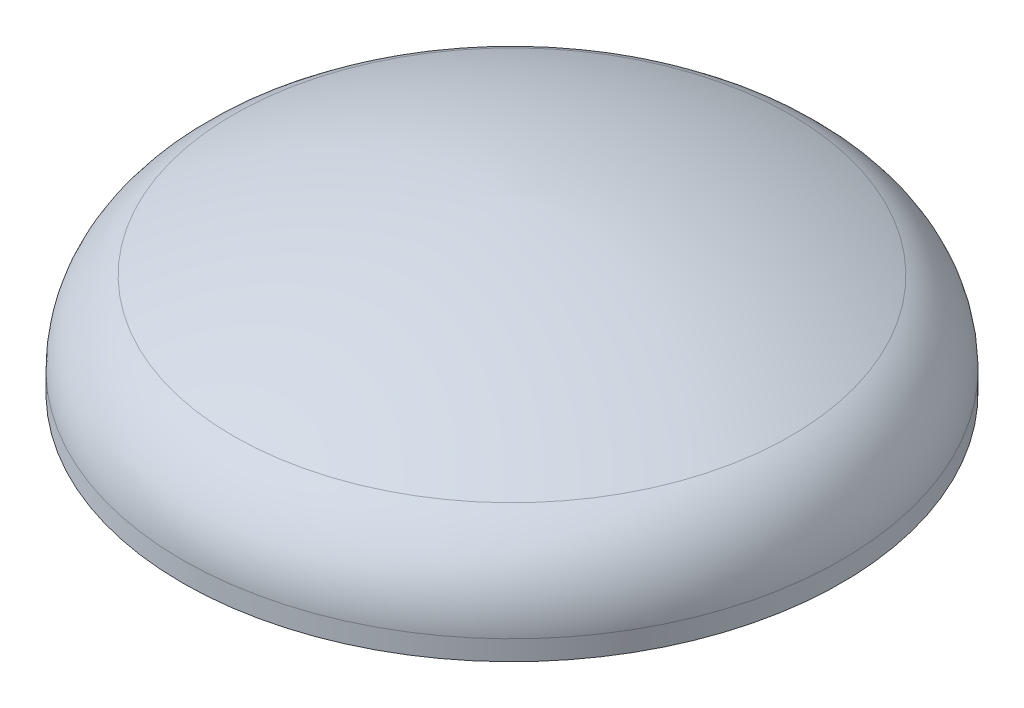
ISO-10303-21;
HEADER;
FILE_DESCRIPTION(('STEP AP214'),'2;1');
FILE_NAME('part.step','',(''),(''),'','','');
FILE_SCHEMA(('AUTOMOTIVE_DESIGN { 1 0 10303 214 1 1 1 1 }'));
ENDSEC;
DATA;
#1=APPLICATION_CONTEXT('core data for automotive mechanical design processes');
#2=APPLICATION_PROTOCOL_DEFINITION('international standard','automotive_design',2000,#1);
#3=PRODUCT_CONTEXT('',#1,'mechanical');
#4=PRODUCT('Part','Part','',(#3));
#5=PRODUCT_RELATED_PRODUCT_CATEGORY('part','',(#4));
#6=PRODUCT_DEFINITION_FORMATION('','',#4);
#7=PRODUCT_DEFINITION_CONTEXT('part definition',#1,'design');
#8=PRODUCT_DEFINITION('design','',#6,#7);
#9=PRODUCT_DEFINITION_SHAPE('','',#8);
#10=(LENGTH_UNIT() NAMED_UNIT(*) SI_UNIT(.MILLI.,.METRE.));
#11=(NAMED_UNIT(*) PLANE_ANGLE_UNIT() SI_UNIT($,.RADIAN.));
#12=(NAMED_UNIT(*) SI_UNIT($,.STERADIAN.) SOLID_ANGLE_UNIT());
#13=UNCERTAINTY_MEASURE_WITH_UNIT(LENGTH_MEASURE(1.E-05),#10,'distance_accuracy_value','');
#14=(GEOMETRIC_REPRESENTATION_CONTEXT(3) GLOBAL_UNCERTAINTY_ASSIGNED_CONTEXT((#13)) GLOBAL_UNIT_ASSIGNED_CONTEXT((#10,
#11,#12)) REPRESENTATION_CONTEXT('',''));
#15=CARTESIAN_POINT('',(0.,0.,0.));
#16=DIRECTION('',(0.,0.,1.));
#17=DIRECTION('',(1.,0.,0.));
#18=AXIS2_PLACEMENT_3D('',#15,#16,#17);
#19=CARTESIAN_POINT('',(0.,2.34505674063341,0.));
#20=DIRECTION('',(0.,1.,0.));
#21=DIRECTION('',(0.,0.,1.));
#22=AXIS2_PLACEMENT_3D('',#19,#20,#21);
#23=CONICAL_SURFACE('',#22,38.05,1.0471975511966);
#24=CARTESIAN_POINT('',(0.,0.670740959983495,0.));
#25=DIRECTION('',(0.,1.,0.));
#26=DIRECTION('',(0.,0.,1.));
#27=AXIS2_PLACEMENT_3D('',#24,#25,#26);
#28=CIRCLE('',#27,35.15);
#29=CARTESIAN_POINT('',(0.,0.670740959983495,35.15));
#30=VERTEX_POINT('',#29);
#31=EDGE_CURVE('E11',#30,#30,#28,.T.);
#32=ORIENTED_EDGE('',*,*,#31,.T.);
#33=EDGE_LOOP('',(#32));
#34=FACE_BOUND('',#33,.T.);
#35=CARTESIAN_POINT('',(0.,2.34505674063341,0.));
#36=DIRECTION('',(0.,1.,0.));
#37=DIRECTION('',(0.,0.,1.));
#38=AXIS2_PLACEMENT_3D('',#35,#36,#37);
#39=CIRCLE('',#38,38.05);
#40=CARTESIAN_POINT('',(0.,2.34505674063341,38.05));
#41=VERTEX_POINT('',#40);
#42=EDGE_CURVE('E74',#41,#41,#39,.T.);
#43=ORIENTED_EDGE('',*,*,#42,.F.);
#44=EDGE_LOOP('',(#43));
#45=FACE_BOUND('',#44,.T.);
#46=ADVANCED_FACE('F42',(#34,#45),#23,.T.);
#47=CARTESIAN_POINT('',(0.,18.1666064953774,0.));
#48=DIRECTION('',(0.,1.,0.));
#49=DIRECTION('',(0.,0.,1.));
#50=AXIS2_PLACEMENT_3D('',#47,#48,#49);
#51=CYLINDRICAL_SURFACE('',#50,35.15);
#52=CARTESIAN_POINT('',(0.,4.63671653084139,0.));
#53=DIRECTION('',(0.,1.,0.));
#54=DIRECTION('',(0.,0.,1.));
#55=AXIS2_PLACEMENT_3D('',#52,#53,#54);
#56=CIRCLE('',#55,35.15);
#57=CARTESIAN_POINT('',(0.,4.63671653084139,35.15));
#58=VERTEX_POINT('',#57);
#59=EDGE_CURVE('E49',#58,#58,#56,.T.);
#60=ORIENTED_EDGE('',*,*,#59,.T.);
#61=EDGE_LOOP('',(#60));
#62=FACE_BOUND('',#61,.T.);
#63=ORIENTED_EDGE('',*,*,#31,.F.);
#64=EDGE_LOOP('',(#63));
#65=FACE_BOUND('',#64,.T.);
#66=ADVANCED_FACE('F82',(#62,#65),#51,.F.);
#67=CARTESIAN_POINT('',(0.,4.63671653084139,0.));
#68=DIRECTION('',(0.,1.,0.));
#69=DIRECTION('',(0.,0.,1.));
#70=AXIS2_PLACEMENT_3D('',#67,#68,#69);
#71=TOROIDAL_SURFACE('',#70,27.54,7.61000000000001);
#72=CARTESIAN_POINT('',(0.,11.4726079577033,0.));
#73=DIRECTION('',(0.,1.,0.));
#74=DIRECTION('',(0.,0.,1.));
#75=AXIS2_PLACEMENT_3D('',#72,#73,#74);
#76=CIRCLE('',#75,30.8840526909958);
#77=CARTESIAN_POINT('',(0.,11.4726079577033,30.8840526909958));
#78=VERTEX_POINT('',#77);
#79=EDGE_CURVE('E63',#78,#78,#76,.T.);
#80=ORIENTED_EDGE('',*,*,#79,.T.);
#81=EDGE_LOOP('',(#80));
#82=FACE_BOUND('',#81,.T.);
#83=ORIENTED_EDGE('',*,*,#59,.F.);
#84=EDGE_LOOP('',(#83));
#85=FACE_BOUND('',#84,.T.);
#86=ADVANCED_FACE('F59',(#82,#85),#71,.F.);
#87=CARTESIAN_POINT('',(0.,-56.8863063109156,-2.55647421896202));
#88=DIRECTION('',(-1.,0.,0.));
#89=DIRECTION('',(0.,0.,1.));
#90=AXIS2_PLACEMENT_3D('',#87,#88,#89);
#91=CIRCLE('',#90,76.1);
#92=TRIMMED_CURVE('',#91,(PARAMETER_VALUE(-1.53719638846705)),
(PARAMETER_VALUE(1.53719638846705)),.T.,.PARAMETER.);
#93=CARTESIAN_POINT('',(0.,-56.8863063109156,0.));
#94=DIRECTION('',(0.,1.,0.));
#95=AXIS1_PLACEMENT('',#93,#94);
#96=SURFACE_OF_REVOLUTION('',#92,#95);
#97=CARTESIAN_POINT('',(0.,19.1707409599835,0.));
#98=VERTEX_POINT('',#97);
#99=VERTEX_LOOP('',#98);
#100=FACE_BOUND('',#99,.T.);
#101=ORIENTED_EDGE('',*,*,#79,.F.);
#102=EDGE_LOOP('',(#101));
#103=FACE_BOUND('',#102,.T.);
#104=ADVANCED_FACE('F55',(#100,#103),#96,.F.);
#105=CARTESIAN_POINT('',(0.,-56.8879956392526,-2.55302069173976));
#106=DIRECTION('',(-1.,0.,0.));
#107=DIRECTION('',(0.,0.,1.));
#108=AXIS2_PLACEMENT_3D('',#105,#106,#107);
#109=CIRCLE('',#108,79.);
#110=TRIMMED_CURVE('',#109,(PARAMETER_VALUE(-1.53847398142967)),
(PARAMETER_VALUE(1.53847398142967)),.T.,.PARAMETER.);
#111=CARTESIAN_POINT('',(0.,-56.8879956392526,0.));
#112=DIRECTION('',(0.,1.,0.));
#113=AXIS1_PLACEMENT('',#111,#112);
#114=SURFACE_OF_REVOLUTION('',#110,#113);
#115=CARTESIAN_POINT('',(0.,14.0776125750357,0.));
#116=DIRECTION('',(0.,1.,0.));
#117=DIRECTION('',(0.,0.,1.));
#118=AXIS2_PLACEMENT_3D('',#115,#116,#117);
#119=CIRCLE('',#118,32.1583960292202);
#120=CARTESIAN_POINT('',(0.,14.0776125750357,32.1583960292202));
#121=VERTEX_POINT('',#120);
#122=EDGE_CURVE('E65',#121,#121,#119,.T.);
#123=ORIENTED_EDGE('',*,*,#122,.T.);
#124=EDGE_LOOP('',(#123));
#125=FACE_BOUND('',#124,.T.);
#126=CARTESIAN_POINT('',(0.,22.0707409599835,0.));
#127=VERTEX_POINT('',#126);
#128=VERTEX_LOOP('',#127);
#129=FACE_BOUND('',#128,.T.);
#130=ADVANCED_FACE('F58',(#125,#129),#114,.T.);
#131=CARTESIAN_POINT('',(0.,4.63671653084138,0.));
#132=DIRECTION('',(0.,1.,0.));
#133=DIRECTION('',(0.,0.,1.));
#134=AXIS2_PLACEMENT_3D('',#131,#132,#133);
#135=TOROIDAL_SURFACE('',#134,27.54,10.51);
#136=CARTESIAN_POINT('',(0.,4.63671653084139,0.));
#137=DIRECTION('',(0.,1.,0.));
#138=DIRECTION('',(0.,0.,1.));
#139=AXIS2_PLACEMENT_3D('',#136,#137,#138);
#140=CIRCLE('',#139,38.05);
#141=CARTESIAN_POINT('',(0.,4.63671653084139,38.05));
#142=VERTEX_POINT('',#141);
#143=EDGE_CURVE('E69',#142,#142,#140,.T.);
#144=ORIENTED_EDGE('',*,*,#143,.T.);
#145=EDGE_LOOP('',(#144));
#146=FACE_BOUND('',#145,.T.);
#147=ORIENTED_EDGE('',*,*,#122,.F.);
#148=EDGE_LOOP('',(#147));
#149=FACE_BOUND('',#148,.T.);
#150=ADVANCED_FACE('F97',(#146,#149),#135,.T.);
#151=CARTESIAN_POINT('',(0.,18.1666064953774,0.));
#152=DIRECTION('',(0.,1.,0.));
#153=DIRECTION('',(0.,0.,1.));
#154=AXIS2_PLACEMENT_3D('',#151,#152,#153);
#155=CYLINDRICAL_SURFACE('',#154,38.05);
#156=ORIENTED_EDGE('',*,*,#42,.T.);
#157=EDGE_LOOP('',(#156));
#158=FACE_BOUND('',#157,.T.);
#159=ORIENTED_EDGE('',*,*,#143,.F.);
#160=EDGE_LOOP('',(#159));
#161=FACE_BOUND('',#160,.T.);
#162=ADVANCED_FACE('F78',(#158,#161),#155,.T.);
#163=CLOSED_SHELL('',(#46,#66,#86,#104,#130,#150,#162));
#164=MANIFOLD_SOLID_BREP('B2',#163);
#165=ADVANCED_BREP_SHAPE_REPRESENTATION('',(#18,#164),#14);
#166=SHAPE_DEFINITION_REPRESENTATION(#9,#165);
ENDSEC;
END-ISO-10303-21;
